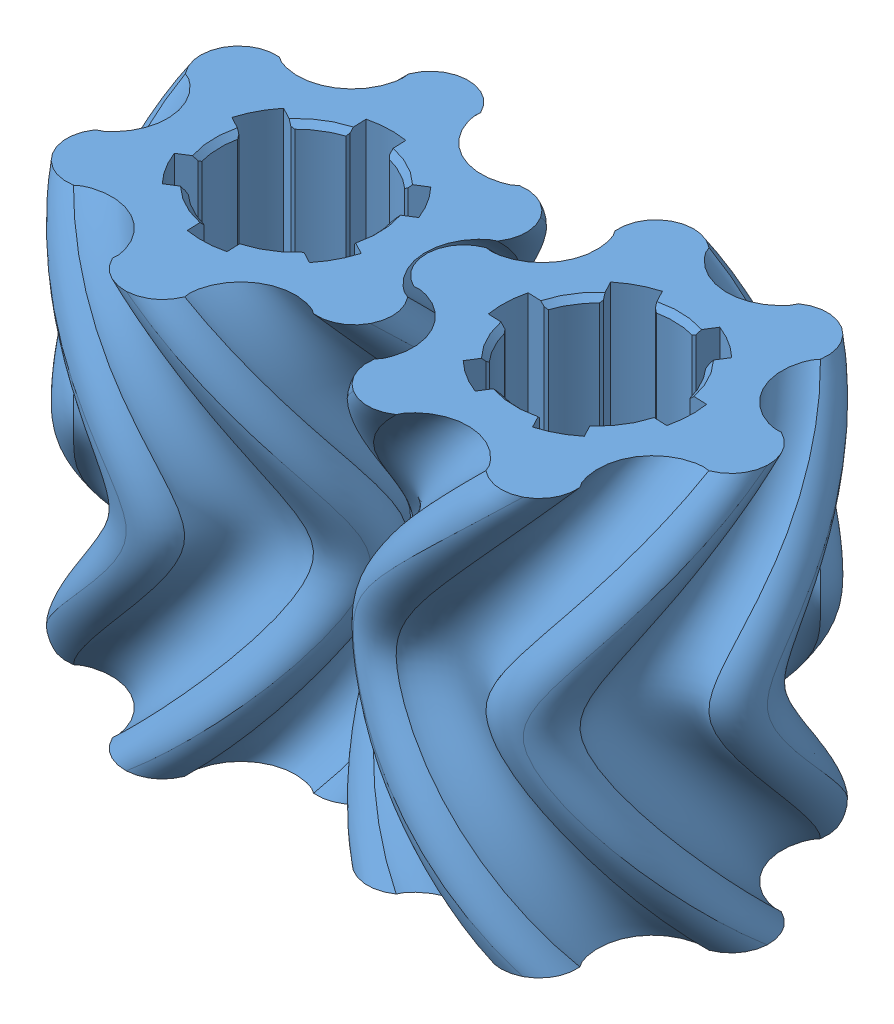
SolidWorks assembly Versuch-12.SLDASM, configuration Standard (file format 5000). Lengths in mm.
Overall size (132.58 75.9 88.3).
2 component instances, 1 part files, 7 mates.
Components (placement in the parent):
- Teigrad_Versuch-12-3: Teigrad_Versuch-12.SLDPRT [Standard] at (-55 37.95 0) x (0.467181 0 -0.884162) z (-0.884162 0 -0.467181) size (65.67 75.9 64.72)
- Teigrad_Versuch-12-4: Teigrad_Versuch-12.SLDPRT [Standard] at (0 37.95 0) x (0.039602 0 -0.999216) z (0.999216 0 0.039602) size (65.67 75.9 64.72)
Mates (geometry in assembly coordinates):
- Deckungsgleich2: coincident: axis of Teigrad_Versuch-12-4 through (0 0 0) axis (0 1 0); plane of assembly
- Deckungsgleich3: coincident: axis of Teigrad_Versuch-12-4 through (0 0 0) axis (0 1 0); plane of assembly
- Deckungsgleich4: coincident anti-aligned: plane of Teigrad_Versuch-12-4 through (0 0 0) normal (0 -1 0); plane of assembly through (0 0 0) normal (0 1 0)
- Deckungsgleich7: coincident aligned: plane of Teigrad_Versuch-12-3 through (-55 0 0) normal (0 -1 0); plane of Teigrad_Versuch-12-4 through (0 0 0) normal (0 -1 0)
- Deckungsgleich8: coincident: axis of Teigrad_Versuch-12-3 through (-55 75.9 0) axis (0 -1 0); plane of assembly
- Abstand2: distance = 55 mm: axis of Teigrad_Versuch-12-3 through (-55 75.9 0) axis (0 -1 0); axis of Teigrad_Versuch-12-4 through (0 0 0) axis (0 1 0)
- Zahnradverknüpfung3: gear = 28 mm: cylinder of Teigrad_Versuch-12-4 through (0 75.9 0) axis (0 -1 0) radius 14; cylinder of Teigrad_Versuch-12-3 through (-55 0 0) axis (0 1 0) radius 14
